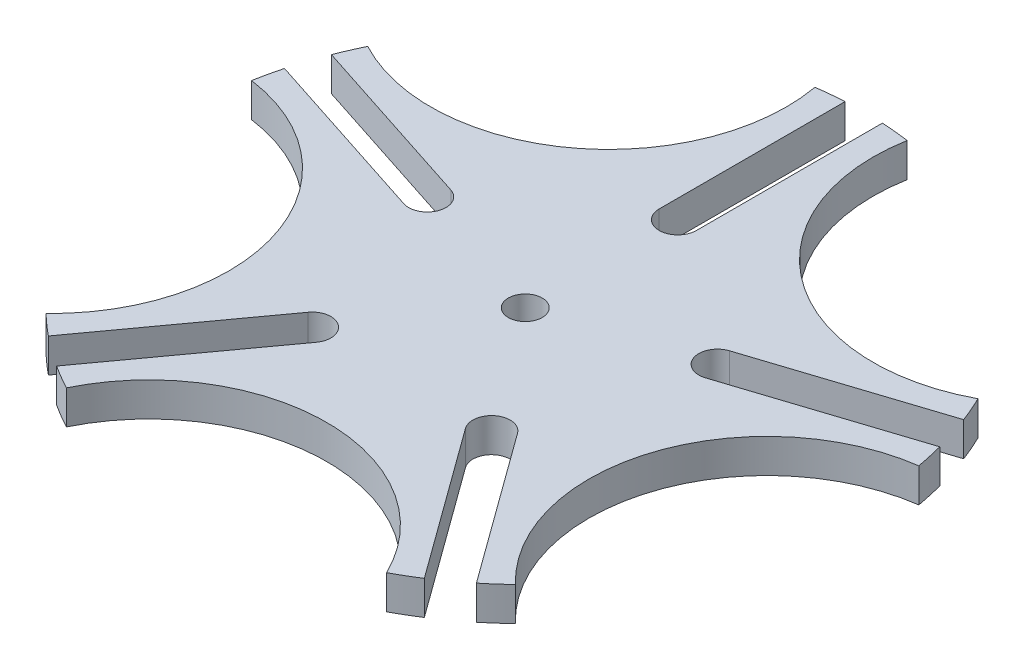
ISO-10303-21;
HEADER;
FILE_DESCRIPTION(('STEP AP214'),'2;1');
FILE_NAME('part.step','',(''),(''),'','','');
FILE_SCHEMA(('AUTOMOTIVE_DESIGN { 1 0 10303 214 1 1 1 1 }'));
ENDSEC;
DATA;
#1=APPLICATION_CONTEXT('core data for automotive mechanical design processes');
#2=APPLICATION_PROTOCOL_DEFINITION('international standard','automotive_design',2000,#1);
#3=PRODUCT_CONTEXT('',#1,'mechanical');
#4=PRODUCT('Part','Part','',(#3));
#5=PRODUCT_RELATED_PRODUCT_CATEGORY('part','',(#4));
#6=PRODUCT_DEFINITION_FORMATION('','',#4);
#7=PRODUCT_DEFINITION_CONTEXT('part definition',#1,'design');
#8=PRODUCT_DEFINITION('design','',#6,#7);
#9=PRODUCT_DEFINITION_SHAPE('','',#8);
#10=(LENGTH_UNIT() NAMED_UNIT(*) SI_UNIT(.MILLI.,.METRE.));
#11=(NAMED_UNIT(*) PLANE_ANGLE_UNIT() SI_UNIT($,.RADIAN.));
#12=(NAMED_UNIT(*) SI_UNIT($,.STERADIAN.) SOLID_ANGLE_UNIT());
#13=UNCERTAINTY_MEASURE_WITH_UNIT(LENGTH_MEASURE(1.E-05),#10,'distance_accuracy_value','');
#14=(GEOMETRIC_REPRESENTATION_CONTEXT(3) GLOBAL_UNCERTAINTY_ASSIGNED_CONTEXT((#13)) GLOBAL_UNIT_ASSIGNED_CONTEXT((#10,
#11,#12)) REPRESENTATION_CONTEXT('',''));
#15=CARTESIAN_POINT('',(0.,0.,0.));
#16=DIRECTION('',(0.,0.,1.));
#17=DIRECTION('',(1.,0.,0.));
#18=AXIS2_PLACEMENT_3D('',#15,#16,#17);
#19=CARTESIAN_POINT('',(0.,10.,0.));
#20=DIRECTION('',(0.,-1.,0.));
#21=DIRECTION('',(0.,0.,-1.));
#22=AXIS2_PLACEMENT_3D('',#19,#20,#21);
#23=CYLINDRICAL_SURFACE('',#22,100.);
#24=CARTESIAN_POINT('',(0.,0.,0.));
#25=DIRECTION('',(0.,1.,0.));
#26=DIRECTION('',(0.,0.,1.));
#27=AXIS2_PLACEMENT_3D('',#24,#25,#26);
#28=CIRCLE('',#27,100.);
#29=CARTESIAN_POINT('',(93.2621019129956,0.,-36.0857360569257));
#30=VERTEX_POINT('',#29);
#31=CARTESIAN_POINT('',(90.0198880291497,0.,-43.5479018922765));
#32=VERTEX_POINT('',#31);
#33=EDGE_CURVE('E264',#30,#32,#28,.T.);
#34=ORIENTED_EDGE('',*,*,#33,.T.);
#35=DIRECTION('',(0.,-1.,0.));
#36=VECTOR('',#35,1.);
#37=CARTESIAN_POINT('',(90.0198880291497,10.,-43.5479018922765));
#38=LINE('',#37,#36);
#39=CARTESIAN_POINT('',(90.0198880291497,10.,-43.5479018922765));
#40=VERTEX_POINT('',#39);
#41=EDGE_CURVE('E11',#40,#32,#38,.T.);
#42=ORIENTED_EDGE('',*,*,#41,.F.);
#43=CARTESIAN_POINT('',(0.,10.,0.));
#44=DIRECTION('',(0.,1.,0.));
#45=DIRECTION('',(0.,0.,1.));
#46=AXIS2_PLACEMENT_3D('',#43,#44,#45);
#47=CIRCLE('',#46,100.);
#48=CARTESIAN_POINT('',(93.2621019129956,10.,-36.0857360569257));
#49=VERTEX_POINT('',#48);
#50=EDGE_CURVE('E152',#49,#40,#47,.T.);
#51=ORIENTED_EDGE('',*,*,#50,.F.);
#52=DIRECTION('',(0.,-1.,0.));
#53=VECTOR('',#52,1.);
#54=CARTESIAN_POINT('',(93.2621019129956,10.,-36.0857360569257));
#55=LINE('',#54,#53);
#56=EDGE_CURVE('E263',#49,#30,#55,.T.);
#57=ORIENTED_EDGE('',*,*,#56,.T.);
#58=EDGE_LOOP('',(#34,#42,#51,#57));
#59=FACE_BOUND('',#58,.T.);
#60=ADVANCED_FACE('F34',(#59),#23,.T.);
#61=CARTESIAN_POINT('',(65.2836420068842,10.,-89.8552245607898));
#62=DIRECTION('',(0.,-1.,0.));
#63=DIRECTION('',(0.,0.,-1.));
#64=AXIS2_PLACEMENT_3D('',#61,#62,#63);
#65=CYLINDRICAL_SURFACE('',#64,52.4999999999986);
#66=CARTESIAN_POINT('',(65.2836420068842,0.,-89.8552245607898));
#67=DIRECTION('',(0.,1.,0.));
#68=DIRECTION('',(0.,0.,1.));
#69=AXIS2_PLACEMENT_3D('',#66,#67,#68);
#70=CIRCLE('',#69,52.4999999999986);
#71=CARTESIAN_POINT('',(13.598840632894,0.,-99.0710428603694));
#72=VERTEX_POINT('',#71);
#73=EDGE_CURVE('E267',#72,#32,#70,.T.);
#74=ORIENTED_EDGE('',*,*,#73,.F.);
#75=DIRECTION('',(0.,-1.,0.));
#76=VECTOR('',#75,1.);
#77=CARTESIAN_POINT('',(13.598840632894,10.,-99.0710428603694));
#78=LINE('',#77,#76);
#79=CARTESIAN_POINT('',(13.598840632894,10.,-99.0710428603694));
#80=VERTEX_POINT('',#79);
#81=EDGE_CURVE('E42',#80,#72,#78,.T.);
#82=ORIENTED_EDGE('',*,*,#81,.F.);
#83=CARTESIAN_POINT('',(65.2836420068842,10.,-89.8552245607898));
#84=DIRECTION('',(0.,1.,0.));
#85=DIRECTION('',(0.,0.,1.));
#86=AXIS2_PLACEMENT_3D('',#83,#84,#85);
#87=CIRCLE('',#86,52.4999999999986);
#88=EDGE_CURVE('E417',#80,#40,#87,.T.);
#89=ORIENTED_EDGE('',*,*,#88,.T.);
#90=ORIENTED_EDGE('',*,*,#41,.T.);
#91=EDGE_LOOP('',(#74,#82,#89,#90));
#92=FACE_BOUND('',#91,.T.);
#93=ADVANCED_FACE('F416',(#92),#65,.F.);
#94=CARTESIAN_POINT('',(0.,10.,0.));
#95=DIRECTION('',(0.,-1.,0.));
#96=DIRECTION('',(0.,0.,-1.));
#97=AXIS2_PLACEMENT_3D('',#94,#95,#96);
#98=CYLINDRICAL_SURFACE('',#97,100.);
#99=CARTESIAN_POINT('',(0.,0.,0.));
#100=DIRECTION('',(0.,1.,0.));
#101=DIRECTION('',(0.,0.,1.));
#102=AXIS2_PLACEMENT_3D('',#99,#100,#101);
#103=CIRCLE('',#102,100.);
#104=CARTESIAN_POINT('',(5.5,0.,-99.8486354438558));
#105=VERTEX_POINT('',#104);
#106=EDGE_CURVE('E270',#72,#105,#103,.T.);
#107=ORIENTED_EDGE('',*,*,#106,.T.);
#108=DIRECTION('',(0.,-1.,0.));
#109=VECTOR('',#108,1.);
#110=CARTESIAN_POINT('',(5.5,10.,-99.8486354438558));
#111=LINE('',#110,#109);
#112=CARTESIAN_POINT('',(5.5,10.,-99.8486354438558));
#113=VERTEX_POINT('',#112);
#114=EDGE_CURVE('E401',#113,#105,#111,.T.);
#115=ORIENTED_EDGE('',*,*,#114,.F.);
#116=CARTESIAN_POINT('',(0.,10.,0.));
#117=DIRECTION('',(0.,1.,0.));
#118=DIRECTION('',(0.,0.,1.));
#119=AXIS2_PLACEMENT_3D('',#116,#117,#118);
#120=CIRCLE('',#119,100.);
#121=EDGE_CURVE('E407',#80,#113,#120,.T.);
#122=ORIENTED_EDGE('',*,*,#121,.F.);
#123=ORIENTED_EDGE('',*,*,#81,.T.);
#124=EDGE_LOOP('',(#107,#115,#122,#123));
#125=FACE_BOUND('',#124,.T.);
#126=ADVANCED_FACE('F405',(#125),#98,.T.);
#127=CARTESIAN_POINT('',(5.5,10.,0.));
#128=DIRECTION('',(-1.,0.,0.));
#129=DIRECTION('',(0.,0.,1.));
#130=AXIS2_PLACEMENT_3D('',#127,#128,#129);
#131=PLANE('',#130);
#132=DIRECTION('',(0.,0.,-1.));
#133=VECTOR('',#132,1.);
#134=CARTESIAN_POINT('',(5.5,0.,0.));
#135=LINE('',#134,#133);
#136=CARTESIAN_POINT('',(5.5,0.,-45.));
#137=VERTEX_POINT('',#136);
#138=EDGE_CURVE('E273',#137,#105,#135,.T.);
#139=ORIENTED_EDGE('',*,*,#138,.F.);
#140=DIRECTION('',(0.,-1.,0.));
#141=VECTOR('',#140,1.);
#142=CARTESIAN_POINT('',(5.5,10.,-45.));
#143=LINE('',#142,#141);
#144=CARTESIAN_POINT('',(5.5,10.,-45.));
#145=VERTEX_POINT('',#144);
#146=EDGE_CURVE('E399',#145,#137,#143,.T.);
#147=ORIENTED_EDGE('',*,*,#146,.F.);
#148=DIRECTION('',(0.,0.,-1.));
#149=VECTOR('',#148,1.);
#150=CARTESIAN_POINT('',(5.5,10.,0.));
#151=LINE('',#150,#149);
#152=EDGE_CURVE('E535',#145,#113,#151,.T.);
#153=ORIENTED_EDGE('',*,*,#152,.T.);
#154=ORIENTED_EDGE('',*,*,#114,.T.);
#155=EDGE_LOOP('',(#139,#147,#153,#154));
#156=FACE_BOUND('',#155,.T.);
#157=ADVANCED_FACE('F534',(#156),#131,.T.);
#158=CARTESIAN_POINT('',(0.,10.,-45.));
#159=DIRECTION('',(0.,-1.,0.));
#160=DIRECTION('',(0.,0.,-1.));
#161=AXIS2_PLACEMENT_3D('',#158,#159,#160);
#162=CYLINDRICAL_SURFACE('',#161,5.5);
#163=CARTESIAN_POINT('',(0.,0.,-45.));
#164=DIRECTION('',(0.,1.,0.));
#165=DIRECTION('',(0.,0.,1.));
#166=AXIS2_PLACEMENT_3D('',#163,#164,#165);
#167=CIRCLE('',#166,5.5);
#168=CARTESIAN_POINT('',(-5.5,0.,-45.));
#169=VERTEX_POINT('',#168);
#170=EDGE_CURVE('E276',#169,#137,#167,.T.);
#171=ORIENTED_EDGE('',*,*,#170,.F.);
#172=DIRECTION('',(0.,-1.,0.));
#173=VECTOR('',#172,1.);
#174=CARTESIAN_POINT('',(-5.5,10.,-45.));
#175=LINE('',#174,#173);
#176=CARTESIAN_POINT('',(-5.5,10.,-45.));
#177=VERTEX_POINT('',#176);
#178=EDGE_CURVE('E397',#177,#169,#175,.T.);
#179=ORIENTED_EDGE('',*,*,#178,.F.);
#180=CARTESIAN_POINT('',(0.,10.,-45.));
#181=DIRECTION('',(0.,1.,0.));
#182=DIRECTION('',(0.,0.,1.));
#183=AXIS2_PLACEMENT_3D('',#180,#181,#182);
#184=CIRCLE('',#183,5.5);
#185=EDGE_CURVE('E530',#177,#145,#184,.T.);
#186=ORIENTED_EDGE('',*,*,#185,.T.);
#187=ORIENTED_EDGE('',*,*,#146,.T.);
#188=EDGE_LOOP('',(#171,#179,#186,#187));
#189=FACE_BOUND('',#188,.T.);
#190=ADVANCED_FACE('F526',(#189),#162,.F.);
#191=CARTESIAN_POINT('',(-5.5,10.,0.));
#192=DIRECTION('',(-1.,0.,0.));
#193=DIRECTION('',(0.,0.,1.));
#194=AXIS2_PLACEMENT_3D('',#191,#192,#193);
#195=PLANE('',#194);
#196=DIRECTION('',(0.,0.,-1.));
#197=VECTOR('',#196,1.);
#198=CARTESIAN_POINT('',(-5.5,0.,0.));
#199=LINE('',#198,#197);
#200=CARTESIAN_POINT('',(-5.5,0.,-99.8486354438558));
#201=VERTEX_POINT('',#200);
#202=EDGE_CURVE('E279',#169,#201,#199,.T.);
#203=ORIENTED_EDGE('',*,*,#202,.T.);
#204=DIRECTION('',(0.,-1.,0.));
#205=VECTOR('',#204,1.);
#206=CARTESIAN_POINT('',(-5.5,10.,-99.8486354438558));
#207=LINE('',#206,#205);
#208=CARTESIAN_POINT('',(-5.5,10.,-99.8486354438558));
#209=VERTEX_POINT('',#208);
#210=EDGE_CURVE('E394',#209,#201,#207,.T.);
#211=ORIENTED_EDGE('',*,*,#210,.F.);
#212=DIRECTION('',(0.,0.,-1.));
#213=VECTOR('',#212,1.);
#214=CARTESIAN_POINT('',(-5.5,10.,0.));
#215=LINE('',#214,#213);
#216=EDGE_CURVE('E537',#177,#209,#215,.T.);
#217=ORIENTED_EDGE('',*,*,#216,.F.);
#218=ORIENTED_EDGE('',*,*,#178,.T.);
#219=EDGE_LOOP('',(#203,#211,#217,#218));
#220=FACE_BOUND('',#219,.T.);
#221=ADVANCED_FACE('F597',(#220),#195,.F.);
#222=CARTESIAN_POINT('',(0.,10.,0.));
#223=DIRECTION('',(0.,-1.,0.));
#224=DIRECTION('',(0.,0.,-1.));
#225=AXIS2_PLACEMENT_3D('',#222,#223,#224);
#226=CYLINDRICAL_SURFACE('',#225,100.);
#227=CARTESIAN_POINT('',(0.,0.,0.));
#228=DIRECTION('',(0.,1.,0.));
#229=DIRECTION('',(0.,0.,1.));
#230=AXIS2_PLACEMENT_3D('',#227,#228,#229);
#231=CIRCLE('',#230,100.);
#232=CARTESIAN_POINT('',(-13.5988406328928,0.,-99.0710428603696));
#233=VERTEX_POINT('',#232);
#234=EDGE_CURVE('E281',#201,#233,#231,.T.);
#235=ORIENTED_EDGE('',*,*,#234,.T.);
#236=DIRECTION('',(0.,-1.,0.));
#237=VECTOR('',#236,1.);
#238=CARTESIAN_POINT('',(-13.5988406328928,10.,-99.0710428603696));
#239=LINE('',#238,#237);
#240=CARTESIAN_POINT('',(-13.5988406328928,10.,-99.0710428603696));
#241=VERTEX_POINT('',#240);
#242=EDGE_CURVE('E392',#241,#233,#239,.T.);
#243=ORIENTED_EDGE('',*,*,#242,.F.);
#244=CARTESIAN_POINT('',(0.,10.,0.));
#245=DIRECTION('',(0.,1.,0.));
#246=DIRECTION('',(0.,0.,1.));
#247=AXIS2_PLACEMENT_3D('',#244,#245,#246);
#248=CIRCLE('',#247,100.);
#249=EDGE_CURVE('E543',#209,#241,#248,.T.);
#250=ORIENTED_EDGE('',*,*,#249,.F.);
#251=ORIENTED_EDGE('',*,*,#210,.T.);
#252=EDGE_LOOP('',(#235,#243,#250,#251));
#253=FACE_BOUND('',#252,.T.);
#254=ADVANCED_FACE('F520',(#253),#226,.T.);
#255=CARTESIAN_POINT('',(-65.2836420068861,10.,-89.8552245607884));
#256=DIRECTION('',(0.,-1.,0.));
#257=DIRECTION('',(0.,0.,-1.));
#258=AXIS2_PLACEMENT_3D('',#255,#256,#257);
#259=CYLINDRICAL_SURFACE('',#258,52.4999999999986);
#260=CARTESIAN_POINT('',(-65.2836420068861,0.,-89.8552245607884));
#261=DIRECTION('',(0.,1.,0.));
#262=DIRECTION('',(0.,0.,1.));
#263=AXIS2_PLACEMENT_3D('',#260,#261,#262);
#264=CIRCLE('',#263,52.4999999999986);
#265=CARTESIAN_POINT('',(-90.0198880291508,0.,-43.5479018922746));
#266=VERTEX_POINT('',#265);
#267=EDGE_CURVE('E284',#266,#233,#264,.T.);
#268=ORIENTED_EDGE('',*,*,#267,.F.);
#269=DIRECTION('',(0.,-1.,0.));
#270=VECTOR('',#269,1.);
#271=CARTESIAN_POINT('',(-90.0198880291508,10.,-43.5479018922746));
#272=LINE('',#271,#270);
#273=CARTESIAN_POINT('',(-90.0198880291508,10.,-43.5479018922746));
#274=VERTEX_POINT('',#273);
#275=EDGE_CURVE('E390',#274,#266,#272,.T.);
#276=ORIENTED_EDGE('',*,*,#275,.F.);
#277=CARTESIAN_POINT('',(-65.2836420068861,10.,-89.8552245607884));
#278=DIRECTION('',(0.,1.,0.));
#279=DIRECTION('',(0.,0.,1.));
#280=AXIS2_PLACEMENT_3D('',#277,#278,#279);
#281=CIRCLE('',#280,52.4999999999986);
#282=EDGE_CURVE('E517',#274,#241,#281,.T.);
#283=ORIENTED_EDGE('',*,*,#282,.T.);
#284=ORIENTED_EDGE('',*,*,#242,.T.);
#285=EDGE_LOOP('',(#268,#276,#283,#284));
#286=FACE_BOUND('',#285,.T.);
#287=ADVANCED_FACE('F512',(#286),#259,.F.);
#288=CARTESIAN_POINT('',(0.,10.,0.));
#289=DIRECTION('',(0.,-1.,0.));
#290=DIRECTION('',(0.,0.,-1.));
#291=AXIS2_PLACEMENT_3D('',#288,#289,#290);
#292=CYLINDRICAL_SURFACE('',#291,100.);
#293=CARTESIAN_POINT('',(0.,0.,0.));
#294=DIRECTION('',(0.,1.,0.));
#295=DIRECTION('',(0.,0.,1.));
#296=AXIS2_PLACEMENT_3D('',#293,#294,#295);
#297=CIRCLE('',#296,100.);
#298=CARTESIAN_POINT('',(-93.2621019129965,0.,-36.0857360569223));
#299=VERTEX_POINT('',#298);
#300=EDGE_CURVE('E287',#266,#299,#297,.T.);
#301=ORIENTED_EDGE('',*,*,#300,.T.);
#302=DIRECTION('',(0.,-1.,0.));
#303=VECTOR('',#302,1.);
#304=CARTESIAN_POINT('',(-93.2621019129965,10.,-36.0857360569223));
#305=LINE('',#304,#303);
#306=CARTESIAN_POINT('',(-93.2621019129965,10.,-36.0857360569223));
#307=VERTEX_POINT('',#306);
#308=EDGE_CURVE('E388',#307,#299,#305,.T.);
#309=ORIENTED_EDGE('',*,*,#308,.F.);
#310=CARTESIAN_POINT('',(0.,10.,0.));
#311=DIRECTION('',(0.,1.,0.));
#312=DIRECTION('',(0.,0.,1.));
#313=AXIS2_PLACEMENT_3D('',#310,#311,#312);
#314=CIRCLE('',#313,100.);
#315=EDGE_CURVE('E546',#274,#307,#314,.T.);
#316=ORIENTED_EDGE('',*,*,#315,.F.);
#317=ORIENTED_EDGE('',*,*,#275,.T.);
#318=EDGE_LOOP('',(#301,#309,#316,#317));
#319=FACE_BOUND('',#318,.T.);
#320=ADVANCED_FACE('F604',(#319),#292,.T.);
#321=CARTESIAN_POINT('',(1.69959346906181,10.,-5.2308108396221));
#322=DIRECTION('',(-0.309016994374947,0.,0.951056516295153));
#323=DIRECTION('',(0.951056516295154,0.,0.309016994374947));
#324=AXIS2_PLACEMENT_3D('',#321,#322,#323);
#325=PLANE('',#324);
#326=DIRECTION('',(-0.951056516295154,0.,-0.309016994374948));
#327=VECTOR('',#326,1.);
#328=CARTESIAN_POINT('',(1.69959346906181,0.,-5.2308108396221));
#329=LINE('',#328,#327);
#330=CARTESIAN_POINT('',(-41.0979497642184,0.,-19.1365755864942));
#331=VERTEX_POINT('',#330);
#332=EDGE_CURVE('E290',#331,#299,#329,.T.);
#333=ORIENTED_EDGE('',*,*,#332,.F.);
#334=DIRECTION('',(0.,-1.,0.));
#335=VECTOR('',#334,1.);
#336=CARTESIAN_POINT('',(-41.0979497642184,10.,-19.1365755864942));
#337=LINE('',#336,#335);
#338=CARTESIAN_POINT('',(-41.0979497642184,10.,-19.1365755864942));
#339=VERTEX_POINT('',#338);
#340=EDGE_CURVE('E386',#339,#331,#337,.T.);
#341=ORIENTED_EDGE('',*,*,#340,.F.);
#342=DIRECTION('',(-0.951056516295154,0.,-0.309016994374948));
#343=VECTOR('',#342,1.);
#344=CARTESIAN_POINT('',(1.69959346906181,10.,-5.2308108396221));
#345=LINE('',#344,#343);
#346=EDGE_CURVE('E548',#339,#307,#345,.T.);
#347=ORIENTED_EDGE('',*,*,#346,.T.);
#348=ORIENTED_EDGE('',*,*,#308,.T.);
#349=EDGE_LOOP('',(#333,#341,#347,#348));
#350=FACE_BOUND('',#349,.T.);
#351=ADVANCED_FACE('F505',(#350),#325,.T.);
#352=CARTESIAN_POINT('',(-42.7975432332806,10.,-13.9057647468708));
#353=DIRECTION('',(0.,-1.,0.));
#354=DIRECTION('',(0.,0.,-1.));
#355=AXIS2_PLACEMENT_3D('',#352,#353,#354);
#356=CYLINDRICAL_SURFACE('',#355,5.5);
#357=CARTESIAN_POINT('',(-42.7975432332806,0.,-13.9057647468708));
#358=DIRECTION('',(0.,1.,0.));
#359=DIRECTION('',(0.,0.,1.));
#360=AXIS2_PLACEMENT_3D('',#357,#358,#359);
#361=CIRCLE('',#360,5.5);
#362=CARTESIAN_POINT('',(-44.4971367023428,0.,-8.67495390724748));
#363=VERTEX_POINT('',#362);
#364=EDGE_CURVE('E293',#363,#331,#361,.T.);
#365=ORIENTED_EDGE('',*,*,#364,.F.);
#366=DIRECTION('',(0.,-1.,0.));
#367=VECTOR('',#366,1.);
#368=CARTESIAN_POINT('',(-44.4971367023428,10.,-8.67495390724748));
#369=LINE('',#368,#367);
#370=CARTESIAN_POINT('',(-44.4971367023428,10.,-8.67495390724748));
#371=VERTEX_POINT('',#370);
#372=EDGE_CURVE('E384',#371,#363,#369,.T.);
#373=ORIENTED_EDGE('',*,*,#372,.F.);
#374=CARTESIAN_POINT('',(-42.7975432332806,10.,-13.9057647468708));
#375=DIRECTION('',(0.,1.,0.));
#376=DIRECTION('',(0.,0.,1.));
#377=AXIS2_PLACEMENT_3D('',#374,#375,#376);
#378=CIRCLE('',#377,5.5);
#379=EDGE_CURVE('E501',#371,#339,#378,.T.);
#380=ORIENTED_EDGE('',*,*,#379,.T.);
#381=ORIENTED_EDGE('',*,*,#340,.T.);
#382=EDGE_LOOP('',(#365,#373,#380,#381));
#383=FACE_BOUND('',#382,.T.);
#384=ADVANCED_FACE('F496',(#383),#356,.F.);
#385=CARTESIAN_POINT('',(-1.69959346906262,10.,5.23081083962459));
#386=DIRECTION('',(-0.309016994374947,0.,0.951056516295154));
#387=DIRECTION('',(0.951056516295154,0.,0.309016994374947));
#388=AXIS2_PLACEMENT_3D('',#385,#386,#387);
#389=PLANE('',#388);
#390=DIRECTION('',(-0.951056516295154,0.,-0.309016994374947));
#391=VECTOR('',#390,1.);
#392=CARTESIAN_POINT('',(-1.69959346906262,0.,5.23081083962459));
#393=LINE('',#392,#391);
#394=CARTESIAN_POINT('',(-96.6612888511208,0.,-25.6241143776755));
#395=VERTEX_POINT('',#394);
#396=EDGE_CURVE('E296',#363,#395,#393,.T.);
#397=ORIENTED_EDGE('',*,*,#396,.T.);
#398=DIRECTION('',(0.,-1.,0.));
#399=VECTOR('',#398,1.);
#400=CARTESIAN_POINT('',(-96.6612888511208,10.,-25.6241143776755));
#401=LINE('',#400,#399);
#402=CARTESIAN_POINT('',(-96.6612888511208,10.,-25.6241143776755));
#403=VERTEX_POINT('',#402);
#404=EDGE_CURVE('E381',#403,#395,#401,.T.);
#405=ORIENTED_EDGE('',*,*,#404,.F.);
#406=DIRECTION('',(-0.951056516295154,0.,-0.309016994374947));
#407=VECTOR('',#406,1.);
#408=CARTESIAN_POINT('',(-1.69959346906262,10.,5.23081083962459));
#409=LINE('',#408,#407);
#410=EDGE_CURVE('E551',#371,#403,#409,.T.);
#411=ORIENTED_EDGE('',*,*,#410,.F.);
#412=ORIENTED_EDGE('',*,*,#372,.T.);
#413=EDGE_LOOP('',(#397,#405,#411,#412));
#414=FACE_BOUND('',#413,.T.);
#415=ADVANCED_FACE('F611',(#414),#389,.F.);
#416=CARTESIAN_POINT('',(0.,10.,0.));
#417=DIRECTION('',(0.,-1.,0.));
#418=DIRECTION('',(0.,0.,-1.));
#419=AXIS2_PLACEMENT_3D('',#416,#417,#418);
#420=CYLINDRICAL_SURFACE('',#419,100.);
#421=CARTESIAN_POINT('',(0.,0.,0.));
#422=DIRECTION('',(0.,1.,0.));
#423=DIRECTION('',(0.,0.,1.));
#424=AXIS2_PLACEMENT_3D('',#421,#422,#423);
#425=CIRCLE('',#424,100.);
#426=CARTESIAN_POINT('',(-98.4244337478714,0.,-17.6813698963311));
#427=VERTEX_POINT('',#426);
#428=EDGE_CURVE('E298',#395,#427,#425,.T.);
#429=ORIENTED_EDGE('',*,*,#428,.T.);
#430=DIRECTION('',(0.,-1.,0.));
#431=VECTOR('',#430,1.);
#432=CARTESIAN_POINT('',(-98.4244337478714,10.,-17.6813698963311));
#433=LINE('',#432,#431);
#434=CARTESIAN_POINT('',(-98.4244337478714,10.,-17.6813698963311));
#435=VERTEX_POINT('',#434);
#436=EDGE_CURVE('E379',#435,#427,#433,.T.);
#437=ORIENTED_EDGE('',*,*,#436,.F.);
#438=CARTESIAN_POINT('',(0.,10.,0.));
#439=DIRECTION('',(0.,1.,0.));
#440=DIRECTION('',(0.,0.,1.));
#441=AXIS2_PLACEMENT_3D('',#438,#439,#440);
#442=CIRCLE('',#441,100.);
#443=EDGE_CURVE('E553',#403,#435,#442,.T.);
#444=ORIENTED_EDGE('',*,*,#443,.F.);
#445=ORIENTED_EDGE('',*,*,#404,.T.);
#446=EDGE_LOOP('',(#429,#437,#444,#445));
#447=FACE_BOUND('',#446,.T.);
#448=ADVANCED_FACE('F490',(#447),#420,.T.);
#449=CARTESIAN_POINT('',(-105.63115167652,10.,34.3216417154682));
#450=DIRECTION('',(0.,-1.,0.));
#451=DIRECTION('',(0.,0.,-1.));
#452=AXIS2_PLACEMENT_3D('',#449,#450,#451);
#453=CYLINDRICAL_SURFACE('',#452,52.4999999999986);
#454=CARTESIAN_POINT('',(-105.63115167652,0.,34.3216417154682));
#455=DIRECTION('',(0.,1.,0.));
#456=DIRECTION('',(0.,0.,1.));
#457=AXIS2_PLACEMENT_3D('',#454,#455,#456);
#458=CIRCLE('',#457,52.4999999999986);
#459=CARTESIAN_POINT('',(-69.2341910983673,0.,72.1569593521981));
#460=VERTEX_POINT('',#459);
#461=EDGE_CURVE('E301',#460,#427,#458,.T.);
#462=ORIENTED_EDGE('',*,*,#461,.F.);
#463=DIRECTION('',(0.,-1.,0.));
#464=VECTOR('',#463,1.);
#465=CARTESIAN_POINT('',(-69.2341910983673,10.,72.1569593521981));
#466=LINE('',#465,#464);
#467=CARTESIAN_POINT('',(-69.2341910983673,10.,72.1569593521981));
#468=VERTEX_POINT('',#467);
#469=EDGE_CURVE('E377',#468,#460,#466,.T.);
#470=ORIENTED_EDGE('',*,*,#469,.F.);
#471=CARTESIAN_POINT('',(-105.63115167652,10.,34.3216417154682));
#472=DIRECTION('',(0.,1.,0.));
#473=DIRECTION('',(0.,0.,1.));
#474=AXIS2_PLACEMENT_3D('',#471,#472,#473);
#475=CIRCLE('',#474,52.4999999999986);
#476=EDGE_CURVE('E487',#468,#435,#475,.T.);
#477=ORIENTED_EDGE('',*,*,#476,.T.);
#478=ORIENTED_EDGE('',*,*,#436,.T.);
#479=EDGE_LOOP('',(#462,#470,#477,#478));
#480=FACE_BOUND('',#479,.T.);
#481=ADVANCED_FACE('F482',(#480),#453,.F.);
#482=CARTESIAN_POINT('',(0.,10.,0.));
#483=DIRECTION('',(0.,-1.,0.));
#484=DIRECTION('',(0.,0.,-1.));
#485=AXIS2_PLACEMENT_3D('',#482,#483,#484);
#486=CYLINDRICAL_SURFACE('',#485,99.9999999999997);
#487=CARTESIAN_POINT('',(0.,0.,0.));
#488=DIRECTION('',(0.,1.,0.));
#489=DIRECTION('',(0.,0.,1.));
#490=AXIS2_PLACEMENT_3D('',#487,#488,#489);
#491=CIRCLE('',#490,99.9999999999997);
#492=CARTESIAN_POINT('',(-63.1391488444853,0.,77.5464240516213));
#493=VERTEX_POINT('',#492);
#494=EDGE_CURVE('E304',#460,#493,#491,.T.);
#495=ORIENTED_EDGE('',*,*,#494,.T.);
#496=DIRECTION('',(0.,-1.,0.));
#497=VECTOR('',#496,1.);
#498=CARTESIAN_POINT('',(-63.1391488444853,10.,77.5464240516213));
#499=LINE('',#498,#497);
#500=CARTESIAN_POINT('',(-63.1391488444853,10.,77.5464240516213));
#501=VERTEX_POINT('',#500);
#502=EDGE_CURVE('E375',#501,#493,#499,.T.);
#503=ORIENTED_EDGE('',*,*,#502,.F.);
#504=CARTESIAN_POINT('',(0.,10.,0.));
#505=DIRECTION('',(0.,1.,0.));
#506=DIRECTION('',(0.,0.,1.));
#507=AXIS2_PLACEMENT_3D('',#504,#505,#506);
#508=CIRCLE('',#507,99.9999999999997);
#509=EDGE_CURVE('E556',#468,#501,#508,.T.);
#510=ORIENTED_EDGE('',*,*,#509,.F.);
#511=ORIENTED_EDGE('',*,*,#469,.T.);
#512=EDGE_LOOP('',(#495,#503,#510,#511));
#513=FACE_BOUND('',#512,.T.);
#514=ADVANCED_FACE('F618',(#513),#486,.T.);
#515=CARTESIAN_POINT('',(-4.44959346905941,10.,-3.23281888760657));
#516=DIRECTION('',(0.809016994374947,0.,0.587785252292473));
#517=DIRECTION('',(0.587785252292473,0.,-0.809016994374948));
#518=AXIS2_PLACEMENT_3D('',#515,#516,#517);
#519=PLANE('',#518);
#520=DIRECTION('',(-0.587785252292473,0.,0.809016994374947));
#521=VECTOR('',#520,1.);
#522=CARTESIAN_POINT('',(-4.44959346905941,0.,-3.23281888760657));
#523=LINE('',#522,#521);
#524=CARTESIAN_POINT('',(-30.89992982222,0.,33.1729458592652));
#525=VERTEX_POINT('',#524);
#526=EDGE_CURVE('E307',#525,#493,#523,.T.);
#527=ORIENTED_EDGE('',*,*,#526,.F.);
#528=DIRECTION('',(0.,-1.,0.));
#529=VECTOR('',#528,1.);
#530=CARTESIAN_POINT('',(-30.89992982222,10.,33.1729458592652));
#531=LINE('',#530,#529);
#532=CARTESIAN_POINT('',(-30.89992982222,10.,33.1729458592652));
#533=VERTEX_POINT('',#532);
#534=EDGE_CURVE('E373',#533,#525,#531,.T.);
#535=ORIENTED_EDGE('',*,*,#534,.F.);
#536=DIRECTION('',(-0.587785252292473,0.,0.809016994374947));
#537=VECTOR('',#536,1.);
#538=CARTESIAN_POINT('',(-4.44959346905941,10.,-3.23281888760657));
#539=LINE('',#538,#537);
#540=EDGE_CURVE('E558',#533,#501,#539,.T.);
#541=ORIENTED_EDGE('',*,*,#540,.T.);
#542=ORIENTED_EDGE('',*,*,#502,.T.);
#543=EDGE_LOOP('',(#527,#535,#541,#542));
#544=FACE_BOUND('',#543,.T.);
#545=ADVANCED_FACE('F475',(#544),#519,.T.);
#546=CARTESIAN_POINT('',(-26.4503363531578,10.,36.4057647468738));
#547=DIRECTION('',(0.,-1.,0.));
#548=DIRECTION('',(0.,0.,-1.));
#549=AXIS2_PLACEMENT_3D('',#546,#547,#548);
#550=CYLINDRICAL_SURFACE('',#549,5.5);
#551=CARTESIAN_POINT('',(-26.4503363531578,0.,36.4057647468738));
#552=DIRECTION('',(0.,1.,0.));
#553=DIRECTION('',(0.,0.,1.));
#554=AXIS2_PLACEMENT_3D('',#551,#552,#553);
#555=CIRCLE('',#554,5.5);
#556=CARTESIAN_POINT('',(-22.0007428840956,0.,39.6385836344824));
#557=VERTEX_POINT('',#556);
#558=EDGE_CURVE('E310',#557,#525,#555,.T.);
#559=ORIENTED_EDGE('',*,*,#558,.F.);
#560=DIRECTION('',(0.,-1.,0.));
#561=VECTOR('',#560,1.);
#562=CARTESIAN_POINT('',(-22.0007428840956,10.,39.6385836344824));
#563=LINE('',#562,#561);
#564=CARTESIAN_POINT('',(-22.0007428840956,10.,39.6385836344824));
#565=VERTEX_POINT('',#564);
#566=EDGE_CURVE('E371',#565,#557,#563,.T.);
#567=ORIENTED_EDGE('',*,*,#566,.F.);
#568=CARTESIAN_POINT('',(-26.4503363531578,10.,36.4057647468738));
#569=DIRECTION('',(0.,1.,0.));
#570=DIRECTION('',(0.,0.,1.));
#571=AXIS2_PLACEMENT_3D('',#568,#569,#570);
#572=CIRCLE('',#571,5.5);
#573=EDGE_CURVE('E471',#565,#533,#572,.T.);
#574=ORIENTED_EDGE('',*,*,#573,.T.);
#575=ORIENTED_EDGE('',*,*,#534,.T.);
#576=EDGE_LOOP('',(#559,#567,#574,#575));
#577=FACE_BOUND('',#576,.T.);
#578=ADVANCED_FACE('F466',(#577),#550,.F.);
#579=CARTESIAN_POINT('',(4.44959346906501,10.,3.23281888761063));
#580=DIRECTION('',(0.809016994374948,0.,0.587785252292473));
#581=DIRECTION('',(0.587785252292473,0.,-0.809016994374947));
#582=AXIS2_PLACEMENT_3D('',#579,#580,#581);
#583=PLANE('',#582);
#584=DIRECTION('',(-0.587785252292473,0.,0.809016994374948));
#585=VECTOR('',#584,1.);
#586=CARTESIAN_POINT('',(4.44959346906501,0.,3.23281888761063));
#587=LINE('',#586,#585);
#588=CARTESIAN_POINT('',(-54.2399619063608,0.,84.0120618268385));
#589=VERTEX_POINT('',#588);
#590=EDGE_CURVE('E313',#557,#589,#587,.T.);
#591=ORIENTED_EDGE('',*,*,#590,.T.);
#592=DIRECTION('',(0.,-1.,0.));
#593=VECTOR('',#592,1.);
#594=CARTESIAN_POINT('',(-54.2399619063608,10.,84.0120618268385));
#595=LINE('',#594,#593);
#596=CARTESIAN_POINT('',(-54.2399619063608,10.,84.0120618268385));
#597=VERTEX_POINT('',#596);
#598=EDGE_CURVE('E368',#597,#589,#595,.T.);
#599=ORIENTED_EDGE('',*,*,#598,.F.);
#600=DIRECTION('',(-0.587785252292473,0.,0.809016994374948));
#601=VECTOR('',#600,1.);
#602=CARTESIAN_POINT('',(4.44959346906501,10.,3.23281888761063));
#603=LINE('',#602,#601);
#604=EDGE_CURVE('E561',#565,#597,#603,.T.);
#605=ORIENTED_EDGE('',*,*,#604,.F.);
#606=ORIENTED_EDGE('',*,*,#566,.T.);
#607=EDGE_LOOP('',(#591,#599,#605,#606));
#608=FACE_BOUND('',#607,.T.);
#609=ADVANCED_FACE('F625',(#608),#583,.F.);
#610=CARTESIAN_POINT('',(0.,10.,0.));
#611=DIRECTION('',(0.,-1.,0.));
#612=DIRECTION('',(0.,0.,-1.));
#613=AXIS2_PLACEMENT_3D('',#610,#611,#612);
#614=CYLINDRICAL_SURFACE('',#613,100.);
#615=CARTESIAN_POINT('',(0.,0.,0.));
#616=DIRECTION('',(0.,1.,0.));
#617=DIRECTION('',(0.,0.,1.));
#618=AXIS2_PLACEMENT_3D('',#615,#616,#617);
#619=CIRCLE('',#618,100.);
#620=CARTESIAN_POINT('',(-47.2308047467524,0.,88.1433552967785));
#621=VERTEX_POINT('',#620);
#622=EDGE_CURVE('E315',#589,#621,#619,.T.);
#623=ORIENTED_EDGE('',*,*,#622,.T.);
#624=DIRECTION('',(0.,-1.,0.));
#625=VECTOR('',#624,1.);
#626=CARTESIAN_POINT('',(-47.2308047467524,10.,88.1433552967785));
#627=LINE('',#626,#625);
#628=CARTESIAN_POINT('',(-47.2308047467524,10.,88.1433552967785));
#629=VERTEX_POINT('',#628);
#630=EDGE_CURVE('E366',#629,#621,#627,.T.);
#631=ORIENTED_EDGE('',*,*,#630,.F.);
#632=CARTESIAN_POINT('',(0.,10.,0.));
#633=DIRECTION('',(0.,1.,0.));
#634=DIRECTION('',(0.,0.,1.));
#635=AXIS2_PLACEMENT_3D('',#632,#633,#634);
#636=CIRCLE('',#635,100.);
#637=EDGE_CURVE('E563',#597,#629,#636,.T.);
#638=ORIENTED_EDGE('',*,*,#637,.F.);
#639=ORIENTED_EDGE('',*,*,#598,.T.);
#640=EDGE_LOOP('',(#623,#631,#638,#639));
#641=FACE_BOUND('',#640,.T.);
#642=ADVANCED_FACE('F460',(#641),#614,.T.);
#643=CARTESIAN_POINT('',(1.20069232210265E-12,10.,111.067165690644));
#644=DIRECTION('',(0.,-1.,0.));
#645=DIRECTION('',(0.,0.,-1.));
#646=AXIS2_PLACEMENT_3D('',#643,#644,#645);
#647=CYLINDRICAL_SURFACE('',#646,52.4999999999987);
#648=CARTESIAN_POINT('',(1.20069232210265E-12,0.,111.067165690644));
#649=DIRECTION('',(0.,1.,0.));
#650=DIRECTION('',(0.,0.,1.));
#651=AXIS2_PLACEMENT_3D('',#648,#649,#650);
#652=CIRCLE('',#651,52.4999999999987);
#653=CARTESIAN_POINT('',(47.2308047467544,0.,88.1433552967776));
#654=VERTEX_POINT('',#653);
#655=EDGE_CURVE('E318',#654,#621,#652,.T.);
#656=ORIENTED_EDGE('',*,*,#655,.F.);
#657=DIRECTION('',(0.,-1.,0.));
#658=VECTOR('',#657,1.);
#659=CARTESIAN_POINT('',(47.2308047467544,10.,88.1433552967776));
#660=LINE('',#659,#658);
#661=CARTESIAN_POINT('',(47.2308047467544,10.,88.1433552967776));
#662=VERTEX_POINT('',#661);
#663=EDGE_CURVE('E364',#662,#654,#660,.T.);
#664=ORIENTED_EDGE('',*,*,#663,.F.);
#665=CARTESIAN_POINT('',(1.20069232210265E-12,10.,111.067165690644));
#666=DIRECTION('',(0.,1.,0.));
#667=DIRECTION('',(0.,0.,1.));
#668=AXIS2_PLACEMENT_3D('',#665,#666,#667);
#669=CIRCLE('',#668,52.4999999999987);
#670=EDGE_CURVE('E457',#662,#629,#669,.T.);
#671=ORIENTED_EDGE('',*,*,#670,.T.);
#672=ORIENTED_EDGE('',*,*,#630,.T.);
#673=EDGE_LOOP('',(#656,#664,#671,#672));
#674=FACE_BOUND('',#673,.T.);
#675=ADVANCED_FACE('F452',(#674),#647,.F.);
#676=CARTESIAN_POINT('',(0.,10.,0.));
#677=DIRECTION('',(0.,-1.,0.));
#678=DIRECTION('',(0.,0.,-1.));
#679=AXIS2_PLACEMENT_3D('',#676,#677,#678);
#680=CYLINDRICAL_SURFACE('',#679,100.);
#681=CARTESIAN_POINT('',(0.,0.,0.));
#682=DIRECTION('',(0.,1.,0.));
#683=DIRECTION('',(0.,0.,1.));
#684=AXIS2_PLACEMENT_3D('',#681,#682,#683);
#685=CIRCLE('',#684,100.);
#686=CARTESIAN_POINT('',(54.239961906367,0.,84.0120618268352));
#687=VERTEX_POINT('',#686);
#688=EDGE_CURVE('E321',#654,#687,#685,.T.);
#689=ORIENTED_EDGE('',*,*,#688,.T.);
#690=DIRECTION('',(0.,-1.,0.));
#691=VECTOR('',#690,1.);
#692=CARTESIAN_POINT('',(54.239961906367,10.,84.0120618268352));
#693=LINE('',#692,#691);
#694=CARTESIAN_POINT('',(54.239961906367,10.,84.0120618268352));
#695=VERTEX_POINT('',#694);
#696=EDGE_CURVE('E362',#695,#687,#693,.T.);
#697=ORIENTED_EDGE('',*,*,#696,.F.);
#698=CARTESIAN_POINT('',(0.,10.,0.));
#699=DIRECTION('',(0.,1.,0.));
#700=DIRECTION('',(0.,0.,1.));
#701=AXIS2_PLACEMENT_3D('',#698,#699,#700);
#702=CIRCLE('',#701,100.);
#703=EDGE_CURVE('E566',#662,#695,#702,.T.);
#704=ORIENTED_EDGE('',*,*,#703,.F.);
#705=ORIENTED_EDGE('',*,*,#663,.T.);
#706=EDGE_LOOP('',(#689,#697,#704,#705));
#707=FACE_BOUND('',#706,.T.);
#708=ADVANCED_FACE('F632',(#707),#680,.T.);
#709=CARTESIAN_POINT('',(-4.44959346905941,10.,3.23281888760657));
#710=DIRECTION('',(0.809016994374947,0.,-0.587785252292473));
#711=DIRECTION('',(-0.587785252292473,0.,-0.809016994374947));
#712=AXIS2_PLACEMENT_3D('',#709,#710,#711);
#713=PLANE('',#712);
#714=DIRECTION('',(0.587785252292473,0.,0.809016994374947));
#715=VECTOR('',#714,1.);
#716=CARTESIAN_POINT('',(-4.44959346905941,0.,3.23281888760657));
#717=LINE('',#716,#715);
#718=CARTESIAN_POINT('',(22.0007428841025,0.,39.6385836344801));
#719=VERTEX_POINT('',#718);
#720=EDGE_CURVE('E324',#719,#687,#717,.T.);
#721=ORIENTED_EDGE('',*,*,#720,.F.);
#722=DIRECTION('',(0.,-1.,0.));
#723=VECTOR('',#722,1.);
#724=CARTESIAN_POINT('',(22.0007428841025,10.,39.6385836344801));
#725=LINE('',#724,#723);
#726=CARTESIAN_POINT('',(22.0007428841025,10.,39.6385836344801));
#727=VERTEX_POINT('',#726);
#728=EDGE_CURVE('E360',#727,#719,#725,.T.);
#729=ORIENTED_EDGE('',*,*,#728,.F.);
#730=DIRECTION('',(0.587785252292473,0.,0.809016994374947));
#731=VECTOR('',#730,1.);
#732=CARTESIAN_POINT('',(-4.44959346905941,10.,3.23281888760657));
#733=LINE('',#732,#731);
#734=EDGE_CURVE('E568',#727,#695,#733,.T.);
#735=ORIENTED_EDGE('',*,*,#734,.T.);
#736=ORIENTED_EDGE('',*,*,#696,.T.);
#737=EDGE_LOOP('',(#721,#729,#735,#736));
#738=FACE_BOUND('',#737,.T.);
#739=ADVANCED_FACE('F445',(#738),#713,.T.);
#740=CARTESIAN_POINT('',(26.4503363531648,10.,36.4057647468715));
#741=DIRECTION('',(0.,-1.,0.));
#742=DIRECTION('',(0.,0.,-1.));
#743=AXIS2_PLACEMENT_3D('',#740,#741,#742);
#744=CYLINDRICAL_SURFACE('',#743,5.5);
#745=CARTESIAN_POINT('',(26.4503363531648,0.,36.4057647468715));
#746=DIRECTION('',(0.,1.,0.));
#747=DIRECTION('',(0.,0.,1.));
#748=AXIS2_PLACEMENT_3D('',#745,#746,#747);
#749=CIRCLE('',#748,5.5);
#750=CARTESIAN_POINT('',(30.899929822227,0.,33.1729458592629));
#751=VERTEX_POINT('',#750);
#752=EDGE_CURVE('E327',#751,#719,#749,.T.);
#753=ORIENTED_EDGE('',*,*,#752,.F.);
#754=DIRECTION('',(0.,-1.,0.));
#755=VECTOR('',#754,1.);
#756=CARTESIAN_POINT('',(30.899929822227,10.,33.1729458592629));
#757=LINE('',#756,#755);
#758=CARTESIAN_POINT('',(30.899929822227,10.,33.1729458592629));
#759=VERTEX_POINT('',#758);
#760=EDGE_CURVE('E358',#759,#751,#757,.T.);
#761=ORIENTED_EDGE('',*,*,#760,.F.);
#762=CARTESIAN_POINT('',(26.4503363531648,10.,36.4057647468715));
#763=DIRECTION('',(0.,1.,0.));
#764=DIRECTION('',(0.,0.,1.));
#765=AXIS2_PLACEMENT_3D('',#762,#763,#764);
#766=CIRCLE('',#765,5.5);
#767=EDGE_CURVE('E441',#759,#727,#766,.T.);
#768=ORIENTED_EDGE('',*,*,#767,.T.);
#769=ORIENTED_EDGE('',*,*,#728,.T.);
#770=EDGE_LOOP('',(#753,#761,#768,#769));
#771=FACE_BOUND('',#770,.T.);
#772=ADVANCED_FACE('F436',(#771),#744,.F.);
#773=CARTESIAN_POINT('',(4.44959346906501,10.,-3.23281888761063));
#774=DIRECTION('',(0.809016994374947,0.,-0.587785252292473));
#775=DIRECTION('',(-0.587785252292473,0.,-0.809016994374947));
#776=AXIS2_PLACEMENT_3D('',#773,#774,#775);
#777=PLANE('',#776);
#778=DIRECTION('',(0.587785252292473,0.,0.809016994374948));
#779=VECTOR('',#778,1.);
#780=CARTESIAN_POINT('',(4.44959346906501,0.,-3.23281888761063));
#781=LINE('',#780,#779);
#782=CARTESIAN_POINT('',(63.1391488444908,0.,77.5464240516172));
#783=VERTEX_POINT('',#782);
#784=EDGE_CURVE('E330',#751,#783,#781,.T.);
#785=ORIENTED_EDGE('',*,*,#784,.T.);
#786=DIRECTION('',(0.,-1.,0.));
#787=VECTOR('',#786,1.);
#788=CARTESIAN_POINT('',(63.1391488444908,10.,77.5464240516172));
#789=LINE('',#788,#787);
#790=CARTESIAN_POINT('',(63.1391488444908,10.,77.5464240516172));
#791=VERTEX_POINT('',#790);
#792=EDGE_CURVE('E355',#791,#783,#789,.T.);
#793=ORIENTED_EDGE('',*,*,#792,.F.);
#794=DIRECTION('',(0.587785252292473,0.,0.809016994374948));
#795=VECTOR('',#794,1.);
#796=CARTESIAN_POINT('',(4.44959346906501,10.,-3.23281888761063));
#797=LINE('',#796,#795);
#798=EDGE_CURVE('E571',#759,#791,#797,.T.);
#799=ORIENTED_EDGE('',*,*,#798,.F.);
#800=ORIENTED_EDGE('',*,*,#760,.T.);
#801=EDGE_LOOP('',(#785,#793,#799,#800));
#802=FACE_BOUND('',#801,.T.);
#803=ADVANCED_FACE('F575',(#802),#777,.F.);
#804=CARTESIAN_POINT('',(0.,10.,0.));
#805=DIRECTION('',(0.,-1.,0.));
#806=DIRECTION('',(0.,0.,-1.));
#807=AXIS2_PLACEMENT_3D('',#804,#805,#806);
#808=CYLINDRICAL_SURFACE('',#807,100.);
#809=CARTESIAN_POINT('',(0.,0.,0.));
#810=DIRECTION('',(0.,1.,0.));
#811=DIRECTION('',(0.,0.,1.));
#812=AXIS2_PLACEMENT_3D('',#809,#810,#811);
#813=CIRCLE('',#812,100.);
#814=CARTESIAN_POINT('',(69.2341910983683,0.,72.1569593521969));
#815=VERTEX_POINT('',#814);
#816=EDGE_CURVE('E332',#783,#815,#813,.T.);
#817=ORIENTED_EDGE('',*,*,#816,.T.);
#818=DIRECTION('',(0.,-1.,0.));
#819=VECTOR('',#818,1.);
#820=CARTESIAN_POINT('',(69.2341910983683,10.,72.1569593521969));
#821=LINE('',#820,#819);
#822=CARTESIAN_POINT('',(69.2341910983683,10.,72.1569593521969));
#823=VERTEX_POINT('',#822);
#824=EDGE_CURVE('E353',#823,#815,#821,.T.);
#825=ORIENTED_EDGE('',*,*,#824,.F.);
#826=CARTESIAN_POINT('',(0.,10.,0.));
#827=DIRECTION('',(0.,1.,0.));
#828=DIRECTION('',(0.,0.,1.));
#829=AXIS2_PLACEMENT_3D('',#826,#827,#828);
#830=CIRCLE('',#829,100.);
#831=EDGE_CURVE('E573',#791,#823,#830,.T.);
#832=ORIENTED_EDGE('',*,*,#831,.F.);
#833=ORIENTED_EDGE('',*,*,#792,.T.);
#834=EDGE_LOOP('',(#817,#825,#832,#833));
#835=FACE_BOUND('',#834,.T.);
#836=ADVANCED_FACE('F430',(#835),#808,.T.);
#837=CARTESIAN_POINT('',(105.631151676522,10.,34.3216417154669));
#838=DIRECTION('',(0.,-1.,0.));
#839=DIRECTION('',(0.,0.,-1.));
#840=AXIS2_PLACEMENT_3D('',#837,#838,#839);
#841=CYLINDRICAL_SURFACE('',#840,52.4999999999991);
#842=CARTESIAN_POINT('',(105.631151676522,0.,34.3216417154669));
#843=DIRECTION('',(0.,1.,0.));
#844=DIRECTION('',(0.,0.,1.));
#845=AXIS2_PLACEMENT_3D('',#842,#843,#844);
#846=CIRCLE('',#845,52.4999999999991);
#847=CARTESIAN_POINT('',(98.4244337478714,0.,-17.6813698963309));
#848=VERTEX_POINT('',#847);
#849=EDGE_CURVE('E335',#848,#815,#846,.T.);
#850=ORIENTED_EDGE('',*,*,#849,.F.);
#851=DIRECTION('',(0.,-1.,0.));
#852=VECTOR('',#851,1.);
#853=CARTESIAN_POINT('',(98.4244337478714,10.,-17.6813698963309));
#854=LINE('',#853,#852);
#855=CARTESIAN_POINT('',(98.4244337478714,10.,-17.6813698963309));
#856=VERTEX_POINT('',#855);
#857=EDGE_CURVE('E351',#856,#848,#854,.T.);
#858=ORIENTED_EDGE('',*,*,#857,.F.);
#859=CARTESIAN_POINT('',(105.631151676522,10.,34.3216417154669));
#860=DIRECTION('',(0.,1.,0.));
#861=DIRECTION('',(0.,0.,1.));
#862=AXIS2_PLACEMENT_3D('',#859,#860,#861);
#863=CIRCLE('',#862,52.4999999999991);
#864=EDGE_CURVE('E427',#856,#823,#863,.T.);
#865=ORIENTED_EDGE('',*,*,#864,.T.);
#866=ORIENTED_EDGE('',*,*,#824,.T.);
#867=EDGE_LOOP('',(#850,#858,#865,#866));
#868=FACE_BOUND('',#867,.T.);
#869=ADVANCED_FACE('F424',(#868),#841,.F.);
#870=CARTESIAN_POINT('',(0.,10.,0.));
#871=DIRECTION('',(0.,-1.,0.));
#872=DIRECTION('',(0.,0.,-1.));
#873=AXIS2_PLACEMENT_3D('',#870,#871,#872);
#874=CYLINDRICAL_SURFACE('',#873,100.);
#875=CARTESIAN_POINT('',(0.,0.,0.));
#876=DIRECTION('',(0.,1.,0.));
#877=DIRECTION('',(0.,0.,1.));
#878=AXIS2_PLACEMENT_3D('',#875,#876,#877);
#879=CIRCLE('',#878,100.);
#880=CARTESIAN_POINT('',(96.6612888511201,0.,-25.6241143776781));
#881=VERTEX_POINT('',#880);
#882=EDGE_CURVE('E338',#848,#881,#879,.T.);
#883=ORIENTED_EDGE('',*,*,#882,.T.);
#884=DIRECTION('',(0.,-1.,0.));
#885=VECTOR('',#884,1.);
#886=CARTESIAN_POINT('',(96.6612888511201,10.,-25.6241143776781));
#887=LINE('',#886,#885);
#888=CARTESIAN_POINT('',(96.6612888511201,10.,-25.6241143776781));
#889=VERTEX_POINT('',#888);
#890=EDGE_CURVE('E245',#889,#881,#887,.T.);
#891=ORIENTED_EDGE('',*,*,#890,.F.);
#892=CARTESIAN_POINT('',(0.,10.,0.));
#893=DIRECTION('',(0.,1.,0.));
#894=DIRECTION('',(0.,0.,1.));
#895=AXIS2_PLACEMENT_3D('',#892,#893,#894);
#896=CIRCLE('',#895,100.);
#897=EDGE_CURVE('E252',#856,#889,#896,.T.);
#898=ORIENTED_EDGE('',*,*,#897,.F.);
#899=ORIENTED_EDGE('',*,*,#857,.T.);
#900=EDGE_LOOP('',(#883,#891,#898,#899));
#901=FACE_BOUND('',#900,.T.);
#902=ADVANCED_FACE('F663',(#901),#874,.T.);
#903=CARTESIAN_POINT('',(1.69959346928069,10.,5.23081084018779));
#904=DIRECTION('',(-0.309016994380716,0.,-0.951056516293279));
#905=DIRECTION('',(-0.951056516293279,0.,0.309016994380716));
#906=AXIS2_PLACEMENT_3D('',#903,#904,#905);
#907=PLANE('',#906);
#908=DIRECTION('',(0.951056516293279,0.,-0.309016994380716));
#909=VECTOR('',#908,1.);
#910=CARTESIAN_POINT('',(1.69959346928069,0.,5.23081084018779));
#911=LINE('',#910,#909);
#912=CARTESIAN_POINT('',(44.4971367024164,0.,-8.67495390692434));
#913=VERTEX_POINT('',#912);
#914=EDGE_CURVE('E240',#913,#881,#911,.T.);
#915=ORIENTED_EDGE('',*,*,#914,.F.);
#916=DIRECTION('',(0.,-1.,0.));
#917=VECTOR('',#916,1.);
#918=CARTESIAN_POINT('',(44.4971367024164,10.,-8.67495390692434));
#919=LINE('',#918,#917);
#920=CARTESIAN_POINT('',(44.4971367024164,10.,-8.67495390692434));
#921=VERTEX_POINT('',#920);
#922=EDGE_CURVE('E235',#921,#913,#919,.T.);
#923=ORIENTED_EDGE('',*,*,#922,.F.);
#924=DIRECTION('',(0.951056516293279,0.,-0.309016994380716));
#925=VECTOR('',#924,1.);
#926=CARTESIAN_POINT('',(1.69959346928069,10.,5.23081084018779));
#927=LINE('',#926,#925);
#928=EDGE_CURVE('E238',#921,#889,#927,.T.);
#929=ORIENTED_EDGE('',*,*,#928,.T.);
#930=ORIENTED_EDGE('',*,*,#890,.T.);
#931=EDGE_LOOP('',(#915,#923,#929,#930));
#932=FACE_BOUND('',#931,.T.);
#933=ADVANCED_FACE('F237',(#932),#907,.T.);
#934=CARTESIAN_POINT('',(42.7975432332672,10.,-13.9057647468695));
#935=DIRECTION('',(0.,-1.,0.));
#936=DIRECTION('',(0.,0.,-1.));
#937=AXIS2_PLACEMENT_3D('',#934,#935,#936);
#938=CYLINDRICAL_SURFACE('',#937,5.50000000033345);
#939=CARTESIAN_POINT('',(42.7975432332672,0.,-13.9057647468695));
#940=DIRECTION('',(0.,1.,0.));
#941=DIRECTION('',(0.,0.,1.));
#942=AXIS2_PLACEMENT_3D('',#939,#940,#941);
#943=CIRCLE('',#942,5.50000000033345);
#944=CARTESIAN_POINT('',(41.0979497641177,0.,-19.1365755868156));
#945=VERTEX_POINT('',#944);
#946=EDGE_CURVE('E342',#945,#913,#943,.T.);
#947=ORIENTED_EDGE('',*,*,#946,.F.);
#948=DIRECTION('',(0.,-1.,0.));
#949=VECTOR('',#948,1.);
#950=CARTESIAN_POINT('',(41.0979497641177,10.,-19.1365755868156));
#951=LINE('',#950,#949);
#952=CARTESIAN_POINT('',(41.0979497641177,10.,-19.1365755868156));
#953=VERTEX_POINT('',#952);
#954=EDGE_CURVE('E143',#953,#945,#951,.T.);
#955=ORIENTED_EDGE('',*,*,#954,.F.);
#956=CARTESIAN_POINT('',(42.7975432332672,10.,-13.9057647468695));
#957=DIRECTION('',(0.,1.,0.));
#958=DIRECTION('',(0.,0.,1.));
#959=AXIS2_PLACEMENT_3D('',#956,#957,#958);
#960=CIRCLE('',#959,5.50000000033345);
#961=EDGE_CURVE('E249',#953,#921,#960,.T.);
#962=ORIENTED_EDGE('',*,*,#961,.T.);
#963=ORIENTED_EDGE('',*,*,#922,.T.);
#964=EDGE_LOOP('',(#947,#955,#962,#963));
#965=FACE_BOUND('',#964,.T.);
#966=ADVANCED_FACE('F255',(#965),#938,.F.);
#967=CARTESIAN_POINT('',(-1.69959346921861,10.,-5.23081084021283));
#968=DIRECTION('',(-0.309016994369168,0.,-0.951056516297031));
#969=DIRECTION('',(-0.951056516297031,0.,0.309016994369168));
#970=AXIS2_PLACEMENT_3D('',#967,#968,#969);
#971=PLANE('',#970);
#972=DIRECTION('',(0.951056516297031,0.,-0.309016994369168));
#973=VECTOR('',#972,1.);
#974=CARTESIAN_POINT('',(-1.69959346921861,0.,-5.23081084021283));
#975=LINE('',#974,#973);
#976=EDGE_CURVE('E146',#945,#30,#975,.T.);
#977=ORIENTED_EDGE('',*,*,#976,.T.);
#978=ORIENTED_EDGE('',*,*,#56,.F.);
#979=DIRECTION('',(0.951056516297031,0.,-0.309016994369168));
#980=VECTOR('',#979,1.);
#981=CARTESIAN_POINT('',(-1.69959346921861,10.,-5.23081084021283));
#982=LINE('',#981,#980);
#983=EDGE_CURVE('E50',#953,#49,#982,.T.);
#984=ORIENTED_EDGE('',*,*,#983,.F.);
#985=ORIENTED_EDGE('',*,*,#954,.T.);
#986=EDGE_LOOP('',(#977,#978,#984,#985));
#987=FACE_BOUND('',#986,.T.);
#988=ADVANCED_FACE('F688',(#987),#971,.F.);
#989=CARTESIAN_POINT('',(0.,10.,0.));
#990=DIRECTION('',(0.,-1.,0.));
#991=DIRECTION('',(0.,0.,-1.));
#992=AXIS2_PLACEMENT_3D('',#989,#990,#991);
#993=CYLINDRICAL_SURFACE('',#992,5.);
#994=CARTESIAN_POINT('',(0.,10.,0.));
#995=DIRECTION('',(0.,1.,0.));
#996=DIRECTION('',(0.,0.,1.));
#997=AXIS2_PLACEMENT_3D('',#994,#995,#996);
#998=CIRCLE('',#997,5.);
#999=CARTESIAN_POINT('',(0.,10.,5.));
#1000=VERTEX_POINT('',#999);
#1001=EDGE_CURVE('E257',#1000,#1000,#998,.T.);
#1002=ORIENTED_EDGE('',*,*,#1001,.T.);
#1003=EDGE_LOOP('',(#1002));
#1004=FACE_BOUND('',#1003,.T.);
#1005=CARTESIAN_POINT('',(0.,0.,0.));
#1006=DIRECTION('',(0.,1.,0.));
#1007=DIRECTION('',(0.,0.,1.));
#1008=AXIS2_PLACEMENT_3D('',#1005,#1006,#1007);
#1009=CIRCLE('',#1008,5.);
#1010=CARTESIAN_POINT('',(0.,0.,5.));
#1011=VERTEX_POINT('',#1010);
#1012=EDGE_CURVE('E345',#1011,#1011,#1009,.T.);
#1013=ORIENTED_EDGE('',*,*,#1012,.F.);
#1014=EDGE_LOOP('',(#1013));
#1015=FACE_BOUND('',#1014,.T.);
#1016=ADVANCED_FACE('F697',(#1004,#1015),#993,.F.);
#1017=CARTESIAN_POINT('',(0.,10.,0.));
#1018=DIRECTION('',(0.,1.,0.));
#1019=DIRECTION('',(0.,0.,1.));
#1020=AXIS2_PLACEMENT_3D('',#1017,#1018,#1019);
#1021=PLANE('',#1020);
#1022=ORIENTED_EDGE('',*,*,#50,.T.);
#1023=ORIENTED_EDGE('',*,*,#88,.F.);
#1024=ORIENTED_EDGE('',*,*,#121,.T.);
#1025=ORIENTED_EDGE('',*,*,#152,.F.);
#1026=ORIENTED_EDGE('',*,*,#185,.F.);
#1027=ORIENTED_EDGE('',*,*,#216,.T.);
#1028=ORIENTED_EDGE('',*,*,#249,.T.);
#1029=ORIENTED_EDGE('',*,*,#282,.F.);
#1030=ORIENTED_EDGE('',*,*,#315,.T.);
#1031=ORIENTED_EDGE('',*,*,#346,.F.);
#1032=ORIENTED_EDGE('',*,*,#379,.F.);
#1033=ORIENTED_EDGE('',*,*,#410,.T.);
#1034=ORIENTED_EDGE('',*,*,#443,.T.);
#1035=ORIENTED_EDGE('',*,*,#476,.F.);
#1036=ORIENTED_EDGE('',*,*,#509,.T.);
#1037=ORIENTED_EDGE('',*,*,#540,.F.);
#1038=ORIENTED_EDGE('',*,*,#573,.F.);
#1039=ORIENTED_EDGE('',*,*,#604,.T.);
#1040=ORIENTED_EDGE('',*,*,#637,.T.);
#1041=ORIENTED_EDGE('',*,*,#670,.F.);
#1042=ORIENTED_EDGE('',*,*,#703,.T.);
#1043=ORIENTED_EDGE('',*,*,#734,.F.);
#1044=ORIENTED_EDGE('',*,*,#767,.F.);
#1045=ORIENTED_EDGE('',*,*,#798,.T.);
#1046=ORIENTED_EDGE('',*,*,#831,.T.);
#1047=ORIENTED_EDGE('',*,*,#864,.F.);
#1048=ORIENTED_EDGE('',*,*,#897,.T.);
#1049=ORIENTED_EDGE('',*,*,#928,.F.);
#1050=ORIENTED_EDGE('',*,*,#961,.F.);
#1051=ORIENTED_EDGE('',*,*,#983,.T.);
#1052=EDGE_LOOP('',(#1022,#1023,#1024,#1025,#1026,#1027,#1028,#1029,#1030,#1031,#1032,#1033,
#1034,#1035,#1036,#1037,#1038,#1039,#1040,#1041,#1042,#1043,#1044,#1045,#1046,#1047,#1048,#1049,
#1050,#1051));
#1053=FACE_BOUND('',#1052,.T.);
#1054=ORIENTED_EDGE('',*,*,#1001,.F.);
#1055=EDGE_LOOP('',(#1054));
#1056=FACE_BOUND('',#1055,.T.);
#1057=ADVANCED_FACE('F247',(#1053,#1056),#1021,.T.);
#1058=CARTESIAN_POINT('',(0.,0.,0.));
#1059=DIRECTION('',(0.,1.,0.));
#1060=DIRECTION('',(0.,0.,1.));
#1061=AXIS2_PLACEMENT_3D('',#1058,#1059,#1060);
#1062=PLANE('',#1061);
#1063=ORIENTED_EDGE('',*,*,#33,.F.);
#1064=ORIENTED_EDGE('',*,*,#976,.F.);
#1065=ORIENTED_EDGE('',*,*,#946,.T.);
#1066=ORIENTED_EDGE('',*,*,#914,.T.);
#1067=ORIENTED_EDGE('',*,*,#882,.F.);
#1068=ORIENTED_EDGE('',*,*,#849,.T.);
#1069=ORIENTED_EDGE('',*,*,#816,.F.);
#1070=ORIENTED_EDGE('',*,*,#784,.F.);
#1071=ORIENTED_EDGE('',*,*,#752,.T.);
#1072=ORIENTED_EDGE('',*,*,#720,.T.);
#1073=ORIENTED_EDGE('',*,*,#688,.F.);
#1074=ORIENTED_EDGE('',*,*,#655,.T.);
#1075=ORIENTED_EDGE('',*,*,#622,.F.);
#1076=ORIENTED_EDGE('',*,*,#590,.F.);
#1077=ORIENTED_EDGE('',*,*,#558,.T.);
#1078=ORIENTED_EDGE('',*,*,#526,.T.);
#1079=ORIENTED_EDGE('',*,*,#494,.F.);
#1080=ORIENTED_EDGE('',*,*,#461,.T.);
#1081=ORIENTED_EDGE('',*,*,#428,.F.);
#1082=ORIENTED_EDGE('',*,*,#396,.F.);
#1083=ORIENTED_EDGE('',*,*,#364,.T.);
#1084=ORIENTED_EDGE('',*,*,#332,.T.);
#1085=ORIENTED_EDGE('',*,*,#300,.F.);
#1086=ORIENTED_EDGE('',*,*,#267,.T.);
#1087=ORIENTED_EDGE('',*,*,#234,.F.);
#1088=ORIENTED_EDGE('',*,*,#202,.F.);
#1089=ORIENTED_EDGE('',*,*,#170,.T.);
#1090=ORIENTED_EDGE('',*,*,#138,.T.);
#1091=ORIENTED_EDGE('',*,*,#106,.F.);
#1092=ORIENTED_EDGE('',*,*,#73,.T.);
#1093=EDGE_LOOP('',(#1063,#1064,#1065,#1066,#1067,#1068,#1069,#1070,#1071,#1072,#1073,#1074,
#1075,#1076,#1077,#1078,#1079,#1080,#1081,#1082,#1083,#1084,#1085,#1086,#1087,#1088,#1089,#1090,
#1091,#1092));
#1094=FACE_BOUND('',#1093,.T.);
#1095=ORIENTED_EDGE('',*,*,#1012,.T.);
#1096=EDGE_LOOP('',(#1095));
#1097=FACE_BOUND('',#1096,.T.);
#1098=ADVANCED_FACE('F413',(#1094,#1097),#1062,.F.);
#1099=CLOSED_SHELL('',(#60,#93,#126,#157,#190,#221,#254,#287,#320,#351,#384,#415,#448,#481,#514,
#545,#578,#609,#642,#675,#708,#739,#772,#803,#836,#869,#902,#933,#966,#988,#1016,#1057,#1098));
#1100=MANIFOLD_SOLID_BREP('B2',#1099);
#1101=ADVANCED_BREP_SHAPE_REPRESENTATION('',(#18,#1100),#14);
#1102=SHAPE_DEFINITION_REPRESENTATION(#9,#1101);
ENDSEC;
END-ISO-10303-21;
